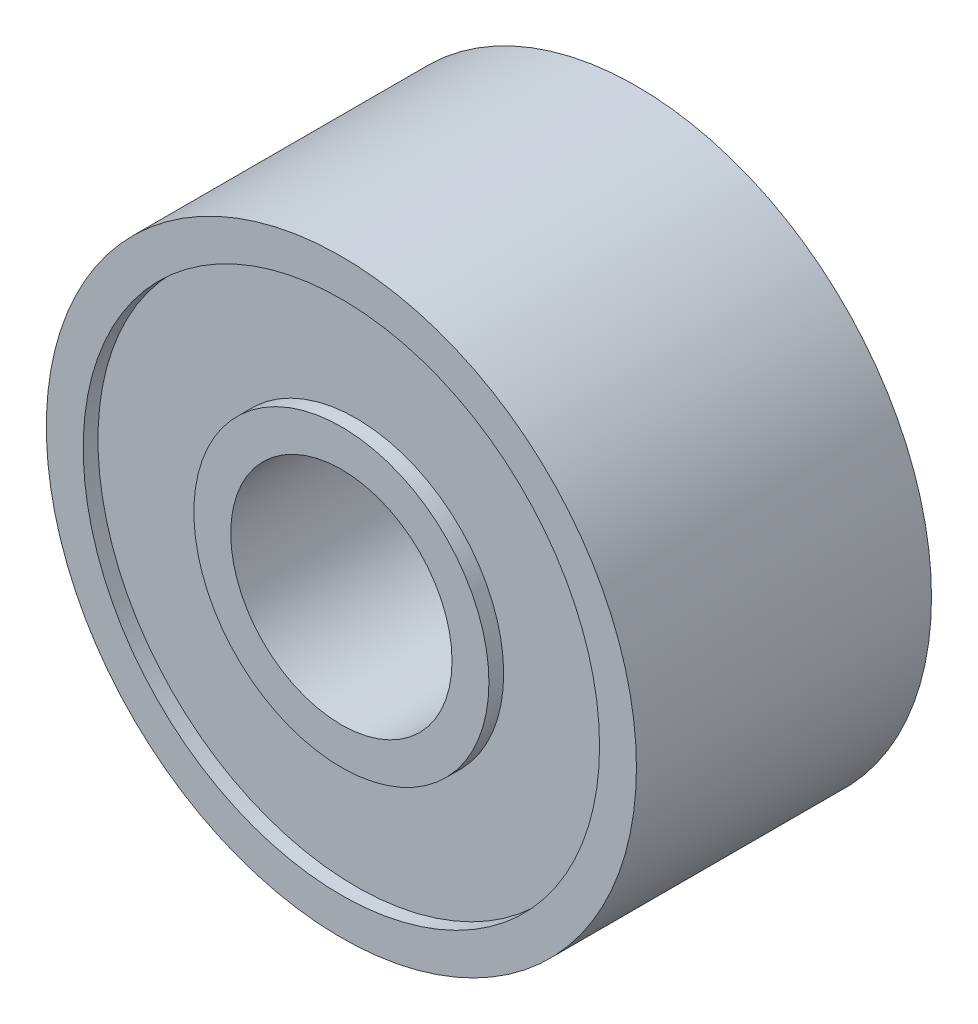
from build123d import *

# Parameters (mm, degrees)
SKETCH_1_R          = 4
SKETCH_1_R_2        = 1.5
EXTRUDE_1_DEPTH     = 4
SKETCH_2_R          = 3.5
SKETCH_2_R_2        = 2
CUT_EXTRUDE_1_DEPTH = 0.2
CUT_EXTRUDE_START   = -0.2
SKETCH_3_R          = 3.5
SKETCH_3_R_2        = 2
CUT_EXTRUDE_2_DEPTH = 0.2


with BuildPart() as part:
    # Sketch 1 → Extrude 1 (new body)
    with BuildSketch(Plane.XY):
        Circle(SKETCH_1_R)
        Circle(SKETCH_1_R_2, mode=Mode.SUBTRACT)
    extrude(amount=EXTRUDE_1_DEPTH)

    # Sketch 2 → Cut-Extrude 1 (cut)
    with BuildSketch(Plane.XY.offset(4)):
        Circle(SKETCH_2_R)
        Circle(SKETCH_2_R_2, mode=Mode.SUBTRACT)
    extrude(amount=-CUT_EXTRUDE_1_DEPTH, mode=Mode.SUBTRACT)

    # Sketch 3 → Cut-Extrude 2 (cut)
    with BuildSketch(Plane(origin=(0, 0, 0), x_dir=(-1, 0, 0), z_dir=(0, 0, -1)).offset(CUT_EXTRUDE_START)):
        with Locations(Location((0, 0, 0), (0, 0, 180))):
            Circle(SKETCH_3_R)
        with Locations(Location((0, 0, 0), (0, 0, 180))):
            Circle(SKETCH_3_R_2, mode=Mode.SUBTRACT)
    extrude(amount=CUT_EXTRUDE_2_DEPTH, mode=Mode.SUBTRACT)


solid = part.part
